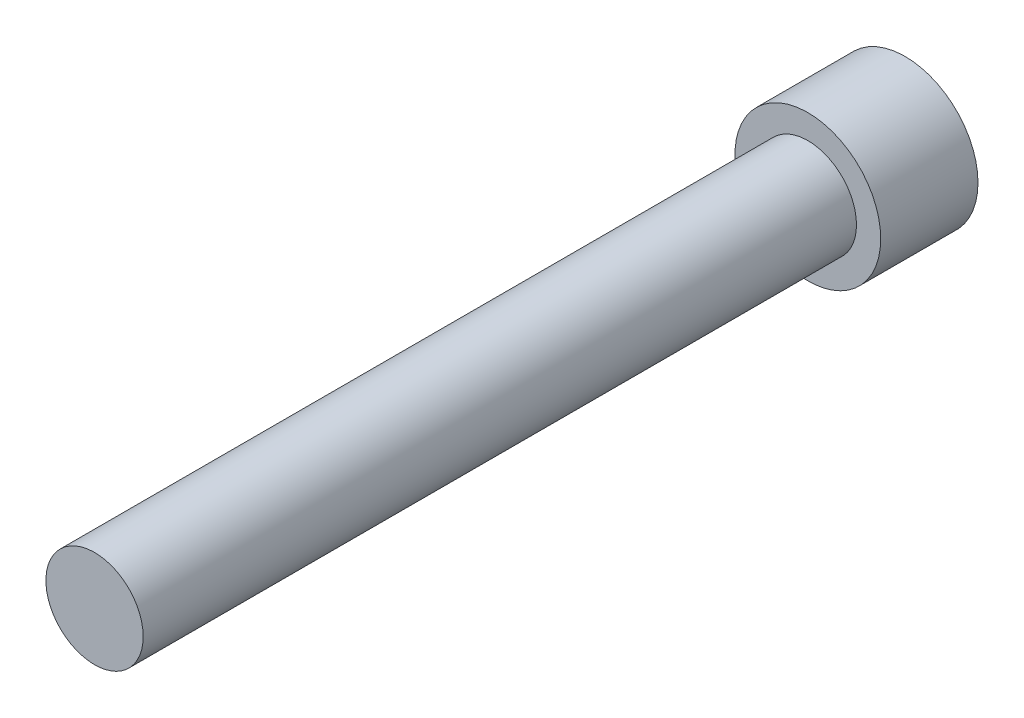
ISO-10303-21;
HEADER;
FILE_DESCRIPTION(('STEP AP214'),'2;1');
FILE_NAME('part.step','',(''),(''),'','','');
FILE_SCHEMA(('AUTOMOTIVE_DESIGN { 1 0 10303 214 1 1 1 1 }'));
ENDSEC;
DATA;
#1=APPLICATION_CONTEXT('core data for automotive mechanical design processes');
#2=APPLICATION_PROTOCOL_DEFINITION('international standard','automotive_design',2000,#1);
#3=PRODUCT_CONTEXT('',#1,'mechanical');
#4=PRODUCT('Part','Part','',(#3));
#5=PRODUCT_RELATED_PRODUCT_CATEGORY('part','',(#4));
#6=PRODUCT_DEFINITION_FORMATION('','',#4);
#7=PRODUCT_DEFINITION_CONTEXT('part definition',#1,'design');
#8=PRODUCT_DEFINITION('design','',#6,#7);
#9=PRODUCT_DEFINITION_SHAPE('','',#8);
#10=(LENGTH_UNIT() NAMED_UNIT(*) SI_UNIT(.MILLI.,.METRE.));
#11=(NAMED_UNIT(*) PLANE_ANGLE_UNIT() SI_UNIT($,.RADIAN.));
#12=(NAMED_UNIT(*) SI_UNIT($,.STERADIAN.) SOLID_ANGLE_UNIT());
#13=UNCERTAINTY_MEASURE_WITH_UNIT(LENGTH_MEASURE(1.E-05),#10,'distance_accuracy_value','');
#14=(GEOMETRIC_REPRESENTATION_CONTEXT(3) GLOBAL_UNCERTAINTY_ASSIGNED_CONTEXT((#13)) GLOBAL_UNIT_ASSIGNED_CONTEXT((#10,
#11,#12)) REPRESENTATION_CONTEXT('',''));
#15=CARTESIAN_POINT('',(0.,0.,0.));
#16=DIRECTION('',(0.,0.,1.));
#17=DIRECTION('',(1.,0.,0.));
#18=AXIS2_PLACEMENT_3D('',#15,#16,#17);
#19=CARTESIAN_POINT('',(0.,0.,69.85));
#20=DIRECTION('',(0.,0.,1.));
#21=DIRECTION('',(1.,0.,0.));
#22=AXIS2_PLACEMENT_3D('',#19,#20,#21);
#23=PLANE('',#22);
#24=CARTESIAN_POINT('',(0.,0.,69.85));
#25=DIRECTION('',(0.,0.,1.));
#26=DIRECTION('',(1.,0.,0.));
#27=AXIS2_PLACEMENT_3D('',#24,#25,#26);
#28=CIRCLE('',#27,4.7625);
#29=CARTESIAN_POINT('',(4.7625,0.,69.85));
#30=VERTEX_POINT('',#29);
#31=EDGE_CURVE('E11',#30,#30,#28,.T.);
#32=ORIENTED_EDGE('',*,*,#31,.T.);
#33=EDGE_LOOP('',(#32));
#34=FACE_BOUND('',#33,.T.);
#35=ADVANCED_FACE('F32',(#34),#23,.T.);
#36=CARTESIAN_POINT('',(0.,0.,69.85));
#37=DIRECTION('',(0.,0.,1.));
#38=DIRECTION('',(1.,0.,0.));
#39=AXIS2_PLACEMENT_3D('',#36,#37,#38);
#40=CYLINDRICAL_SURFACE('',#39,4.7625);
#41=CARTESIAN_POINT('',(0.,0.,0.));
#42=DIRECTION('',(0.,0.,1.));
#43=DIRECTION('',(1.,0.,0.));
#44=AXIS2_PLACEMENT_3D('',#41,#42,#43);
#45=CIRCLE('',#44,4.7625);
#46=CARTESIAN_POINT('',(4.7625,0.,0.));
#47=VERTEX_POINT('',#46);
#48=EDGE_CURVE('E39',#47,#47,#45,.T.);
#49=ORIENTED_EDGE('',*,*,#48,.T.);
#50=EDGE_LOOP('',(#49));
#51=FACE_BOUND('',#50,.T.);
#52=ORIENTED_EDGE('',*,*,#31,.F.);
#53=EDGE_LOOP('',(#52));
#54=FACE_BOUND('',#53,.T.);
#55=ADVANCED_FACE('F146',(#51,#54),#40,.T.);
#56=CARTESIAN_POINT('',(0.,-4.7625,0.));
#57=DIRECTION('',(0.,0.,1.));
#58=DIRECTION('',(1.,0.,0.));
#59=AXIS2_PLACEMENT_3D('',#56,#57,#58);
#60=PLANE('',#59);
#61=CARTESIAN_POINT('',(0.,0.,0.));
#62=DIRECTION('',(0.,0.,1.));
#63=DIRECTION('',(1.,0.,0.));
#64=AXIS2_PLACEMENT_3D('',#61,#62,#63);
#65=CIRCLE('',#64,7.1374);
#66=CARTESIAN_POINT('',(7.1374,0.,0.));
#67=VERTEX_POINT('',#66);
#68=EDGE_CURVE('E141',#67,#67,#65,.T.);
#69=ORIENTED_EDGE('',*,*,#68,.T.);
#70=EDGE_LOOP('',(#69));
#71=FACE_BOUND('',#70,.T.);
#72=ORIENTED_EDGE('',*,*,#48,.F.);
#73=EDGE_LOOP('',(#72));
#74=FACE_BOUND('',#73,.T.);
#75=ADVANCED_FACE('F149',(#71,#74),#60,.T.);
#76=CARTESIAN_POINT('',(0.,0.,69.85));
#77=DIRECTION('',(0.,0.,1.));
#78=DIRECTION('',(1.,0.,0.));
#79=AXIS2_PLACEMENT_3D('',#76,#77,#78);
#80=CYLINDRICAL_SURFACE('',#79,7.1374);
#81=CARTESIAN_POINT('',(0.,0.,-9.52500000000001));
#82=DIRECTION('',(0.,0.,1.));
#83=DIRECTION('',(1.,0.,0.));
#84=AXIS2_PLACEMENT_3D('',#81,#82,#83);
#85=CIRCLE('',#84,7.1374);
#86=CARTESIAN_POINT('',(7.1374,0.,-9.52500000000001));
#87=VERTEX_POINT('',#86);
#88=EDGE_CURVE('E133',#87,#87,#85,.T.);
#89=ORIENTED_EDGE('',*,*,#88,.T.);
#90=EDGE_LOOP('',(#89));
#91=FACE_BOUND('',#90,.T.);
#92=ORIENTED_EDGE('',*,*,#68,.F.);
#93=EDGE_LOOP('',(#92));
#94=FACE_BOUND('',#93,.T.);
#95=ADVANCED_FACE('F151',(#91,#94),#80,.T.);
#96=CARTESIAN_POINT('',(0.,-7.1374,-9.525));
#97=DIRECTION('',(0.,0.,-1.));
#98=DIRECTION('',(-1.,0.,0.));
#99=AXIS2_PLACEMENT_3D('',#96,#97,#98);
#100=PLANE('',#99);
#101=DIRECTION('',(0.866025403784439,-0.5,0.));
#102=VECTOR('',#101,1.);
#103=CARTESIAN_POINT('',(0.,4.57538541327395,-9.525));
#104=LINE('',#103,#102);
#105=CARTESIAN_POINT('',(0.,4.57538541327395,-9.525));
#106=VERTEX_POINT('',#105);
#107=CARTESIAN_POINT('',(3.9624,2.28769270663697,-9.525));
#108=VERTEX_POINT('',#107);
#109=EDGE_CURVE('E46',#106,#108,#104,.T.);
#110=ORIENTED_EDGE('',*,*,#109,.F.);
#111=DIRECTION('',(0.866025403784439,0.5,0.));
#112=VECTOR('',#111,1.);
#113=CARTESIAN_POINT('',(-3.9624,2.28769270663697,-9.525));
#114=LINE('',#113,#112);
#115=CARTESIAN_POINT('',(-3.9624,2.28769270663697,-9.525));
#116=VERTEX_POINT('',#115);
#117=EDGE_CURVE('E129',#116,#106,#114,.T.);
#118=ORIENTED_EDGE('',*,*,#117,.F.);
#119=DIRECTION('',(0.,1.,0.));
#120=VECTOR('',#119,1.);
#121=CARTESIAN_POINT('',(-3.9624,-2.28769270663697,-9.525));
#122=LINE('',#121,#120);
#123=CARTESIAN_POINT('',(-3.9624,-2.28769270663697,-9.525));
#124=VERTEX_POINT('',#123);
#125=EDGE_CURVE('E127',#124,#116,#122,.T.);
#126=ORIENTED_EDGE('',*,*,#125,.F.);
#127=DIRECTION('',(-0.866025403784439,0.5,0.));
#128=VECTOR('',#127,1.);
#129=CARTESIAN_POINT('',(0.,-4.57538541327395,-9.525));
#130=LINE('',#129,#128);
#131=CARTESIAN_POINT('',(0.,-4.57538541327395,-9.525));
#132=VERTEX_POINT('',#131);
#133=EDGE_CURVE('E94',#132,#124,#130,.T.);
#134=ORIENTED_EDGE('',*,*,#133,.F.);
#135=DIRECTION('',(-0.866025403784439,-0.5,0.));
#136=VECTOR('',#135,1.);
#137=CARTESIAN_POINT('',(3.9624,-2.28769270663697,-9.525));
#138=LINE('',#137,#136);
#139=CARTESIAN_POINT('',(3.9624,-2.28769270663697,-9.525));
#140=VERTEX_POINT('',#139);
#141=EDGE_CURVE('E123',#140,#132,#138,.T.);
#142=ORIENTED_EDGE('',*,*,#141,.F.);
#143=DIRECTION('',(0.,-1.,0.));
#144=VECTOR('',#143,1.);
#145=CARTESIAN_POINT('',(3.9624,2.28769270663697,-9.525));
#146=LINE('',#145,#144);
#147=EDGE_CURVE('E120',#108,#140,#146,.T.);
#148=ORIENTED_EDGE('',*,*,#147,.F.);
#149=EDGE_LOOP('',(#110,#118,#126,#134,#142,#148));
#150=FACE_BOUND('',#149,.T.);
#151=ORIENTED_EDGE('',*,*,#88,.F.);
#152=EDGE_LOOP('',(#151));
#153=FACE_BOUND('',#152,.T.);
#154=ADVANCED_FACE('F158',(#150,#153),#100,.T.);
#155=CARTESIAN_POINT('',(0.,4.57538541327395,-3.683));
#156=DIRECTION('',(0.5,0.866025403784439,0.));
#157=DIRECTION('',(-0.866025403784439,0.5,0.));
#158=AXIS2_PLACEMENT_3D('',#155,#156,#157);
#159=PLANE('',#158);
#160=ORIENTED_EDGE('',*,*,#109,.T.);
#161=DIRECTION('',(0.,0.,-1.));
#162=VECTOR('',#161,1.);
#163=CARTESIAN_POINT('',(3.9624,2.28769270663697,-3.683));
#164=LINE('',#163,#162);
#165=CARTESIAN_POINT('',(3.9624,2.28769270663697,-3.683));
#166=VERTEX_POINT('',#165);
#167=EDGE_CURVE('E76',#166,#108,#164,.T.);
#168=ORIENTED_EDGE('',*,*,#167,.F.);
#169=DIRECTION('',(0.866025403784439,-0.5,0.));
#170=VECTOR('',#169,1.);
#171=CARTESIAN_POINT('',(0.,4.57538541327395,-3.683));
#172=LINE('',#171,#170);
#173=CARTESIAN_POINT('',(0.,4.57538541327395,-3.683));
#174=VERTEX_POINT('',#173);
#175=EDGE_CURVE('E131',#174,#166,#172,.T.);
#176=ORIENTED_EDGE('',*,*,#175,.F.);
#177=DIRECTION('',(0.,0.,-1.));
#178=VECTOR('',#177,1.);
#179=CARTESIAN_POINT('',(0.,4.57538541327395,-3.683));
#180=LINE('',#179,#178);
#181=EDGE_CURVE('E54',#174,#106,#180,.T.);
#182=ORIENTED_EDGE('',*,*,#181,.T.);
#183=EDGE_LOOP('',(#160,#168,#176,#182));
#184=FACE_BOUND('',#183,.T.);
#185=ADVANCED_FACE('F189',(#184),#159,.F.);
#186=CARTESIAN_POINT('',(-3.9624,2.28769270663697,-3.683));
#187=DIRECTION('',(-0.5,0.866025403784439,0.));
#188=DIRECTION('',(-0.866025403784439,-0.5,0.));
#189=AXIS2_PLACEMENT_3D('',#186,#187,#188);
#190=PLANE('',#189);
#191=ORIENTED_EDGE('',*,*,#117,.T.);
#192=ORIENTED_EDGE('',*,*,#181,.F.);
#193=DIRECTION('',(0.866025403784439,0.5,0.));
#194=VECTOR('',#193,1.);
#195=CARTESIAN_POINT('',(-3.9624,2.28769270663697,-3.683));
#196=LINE('',#195,#194);
#197=CARTESIAN_POINT('',(-3.9624,2.28769270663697,-3.683));
#198=VERTEX_POINT('',#197);
#199=EDGE_CURVE('E106',#198,#174,#196,.T.);
#200=ORIENTED_EDGE('',*,*,#199,.F.);
#201=DIRECTION('',(0.,0.,-1.));
#202=VECTOR('',#201,1.);
#203=CARTESIAN_POINT('',(-3.9624,2.28769270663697,-3.683));
#204=LINE('',#203,#202);
#205=EDGE_CURVE('E98',#198,#116,#204,.T.);
#206=ORIENTED_EDGE('',*,*,#205,.T.);
#207=EDGE_LOOP('',(#191,#192,#200,#206));
#208=FACE_BOUND('',#207,.T.);
#209=ADVANCED_FACE('F199',(#208),#190,.F.);
#210=CARTESIAN_POINT('',(-3.9624,-2.28769270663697,-3.683));
#211=DIRECTION('',(-1.,0.,0.));
#212=DIRECTION('',(0.,0.,1.));
#213=AXIS2_PLACEMENT_3D('',#210,#211,#212);
#214=PLANE('',#213);
#215=ORIENTED_EDGE('',*,*,#125,.T.);
#216=ORIENTED_EDGE('',*,*,#205,.F.);
#217=DIRECTION('',(0.,1.,0.));
#218=VECTOR('',#217,1.);
#219=CARTESIAN_POINT('',(-3.9624,-2.28769270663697,-3.683));
#220=LINE('',#219,#218);
#221=CARTESIAN_POINT('',(-3.9624,-2.28769270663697,-3.683));
#222=VERTEX_POINT('',#221);
#223=EDGE_CURVE('E102',#222,#198,#220,.T.);
#224=ORIENTED_EDGE('',*,*,#223,.F.);
#225=DIRECTION('',(0.,0.,-1.));
#226=VECTOR('',#225,1.);
#227=CARTESIAN_POINT('',(-3.9624,-2.28769270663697,-3.683));
#228=LINE('',#227,#226);
#229=EDGE_CURVE('E87',#222,#124,#228,.T.);
#230=ORIENTED_EDGE('',*,*,#229,.T.);
#231=EDGE_LOOP('',(#215,#216,#224,#230));
#232=FACE_BOUND('',#231,.T.);
#233=ADVANCED_FACE('F103',(#232),#214,.F.);
#234=CARTESIAN_POINT('',(0.,-4.57538541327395,-3.683));
#235=DIRECTION('',(-0.5,-0.866025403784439,0.));
#236=DIRECTION('',(0.866025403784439,-0.5,0.));
#237=AXIS2_PLACEMENT_3D('',#234,#235,#236);
#238=PLANE('',#237);
#239=ORIENTED_EDGE('',*,*,#133,.T.);
#240=ORIENTED_EDGE('',*,*,#229,.F.);
#241=DIRECTION('',(-0.866025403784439,0.5,0.));
#242=VECTOR('',#241,1.);
#243=CARTESIAN_POINT('',(0.,-4.57538541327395,-3.683));
#244=LINE('',#243,#242);
#245=CARTESIAN_POINT('',(0.,-4.57538541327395,-3.683));
#246=VERTEX_POINT('',#245);
#247=EDGE_CURVE('E91',#246,#222,#244,.T.);
#248=ORIENTED_EDGE('',*,*,#247,.F.);
#249=DIRECTION('',(0.,0.,-1.));
#250=VECTOR('',#249,1.);
#251=CARTESIAN_POINT('',(0.,-4.57538541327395,-3.683));
#252=LINE('',#251,#250);
#253=EDGE_CURVE('E99',#246,#132,#252,.T.);
#254=ORIENTED_EDGE('',*,*,#253,.T.);
#255=EDGE_LOOP('',(#239,#240,#248,#254));
#256=FACE_BOUND('',#255,.T.);
#257=ADVANCED_FACE('F89',(#256),#238,.F.);
#258=CARTESIAN_POINT('',(3.9624,-2.28769270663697,-3.683));
#259=DIRECTION('',(0.5,-0.866025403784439,0.));
#260=DIRECTION('',(0.866025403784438,0.5,0.));
#261=AXIS2_PLACEMENT_3D('',#258,#259,#260);
#262=PLANE('',#261);
#263=ORIENTED_EDGE('',*,*,#141,.T.);
#264=ORIENTED_EDGE('',*,*,#253,.F.);
#265=DIRECTION('',(-0.866025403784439,-0.5,0.));
#266=VECTOR('',#265,1.);
#267=CARTESIAN_POINT('',(3.9624,-2.28769270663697,-3.683));
#268=LINE('',#267,#266);
#269=CARTESIAN_POINT('',(3.9624,-2.28769270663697,-3.683));
#270=VERTEX_POINT('',#269);
#271=EDGE_CURVE('E112',#270,#246,#268,.T.);
#272=ORIENTED_EDGE('',*,*,#271,.F.);
#273=DIRECTION('',(0.,0.,-1.));
#274=VECTOR('',#273,1.);
#275=CARTESIAN_POINT('',(3.9624,-2.28769270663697,-3.683));
#276=LINE('',#275,#274);
#277=EDGE_CURVE('E136',#270,#140,#276,.T.);
#278=ORIENTED_EDGE('',*,*,#277,.T.);
#279=EDGE_LOOP('',(#263,#264,#272,#278));
#280=FACE_BOUND('',#279,.T.);
#281=ADVANCED_FACE('F224',(#280),#262,.F.);
#282=CARTESIAN_POINT('',(3.9624,2.28769270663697,-3.683));
#283=DIRECTION('',(1.,0.,0.));
#284=DIRECTION('',(0.,0.,-1.));
#285=AXIS2_PLACEMENT_3D('',#282,#283,#284);
#286=PLANE('',#285);
#287=ORIENTED_EDGE('',*,*,#147,.T.);
#288=ORIENTED_EDGE('',*,*,#277,.F.);
#289=DIRECTION('',(0.,-1.,0.));
#290=VECTOR('',#289,1.);
#291=CARTESIAN_POINT('',(3.9624,2.28769270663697,-3.683));
#292=LINE('',#291,#290);
#293=EDGE_CURVE('E114',#166,#270,#292,.T.);
#294=ORIENTED_EDGE('',*,*,#293,.F.);
#295=ORIENTED_EDGE('',*,*,#167,.T.);
#296=EDGE_LOOP('',(#287,#288,#294,#295));
#297=FACE_BOUND('',#296,.T.);
#298=ADVANCED_FACE('F233',(#297),#286,.F.);
#299=CARTESIAN_POINT('',(7.9248,0.,-3.683));
#300=DIRECTION('',(0.,0.,-1.));
#301=DIRECTION('',(-1.,0.,0.));
#302=AXIS2_PLACEMENT_3D('',#299,#300,#301);
#303=PLANE('',#302);
#304=ORIENTED_EDGE('',*,*,#175,.T.);
#305=ORIENTED_EDGE('',*,*,#293,.T.);
#306=ORIENTED_EDGE('',*,*,#271,.T.);
#307=ORIENTED_EDGE('',*,*,#247,.T.);
#308=ORIENTED_EDGE('',*,*,#223,.T.);
#309=ORIENTED_EDGE('',*,*,#199,.T.);
#310=EDGE_LOOP('',(#304,#305,#306,#307,#308,#309));
#311=FACE_BOUND('',#310,.T.);
#312=ADVANCED_FACE('F109',(#311),#303,.T.);
#313=CLOSED_SHELL('',(#35,#55,#75,#95,#154,#185,#209,#233,#257,#281,#298,#312));
#314=MANIFOLD_SOLID_BREP('B2',#313);
#315=ADVANCED_BREP_SHAPE_REPRESENTATION('',(#18,#314),#14);
#316=SHAPE_DEFINITION_REPRESENTATION(#9,#315);
ENDSEC;
END-ISO-10303-21;
